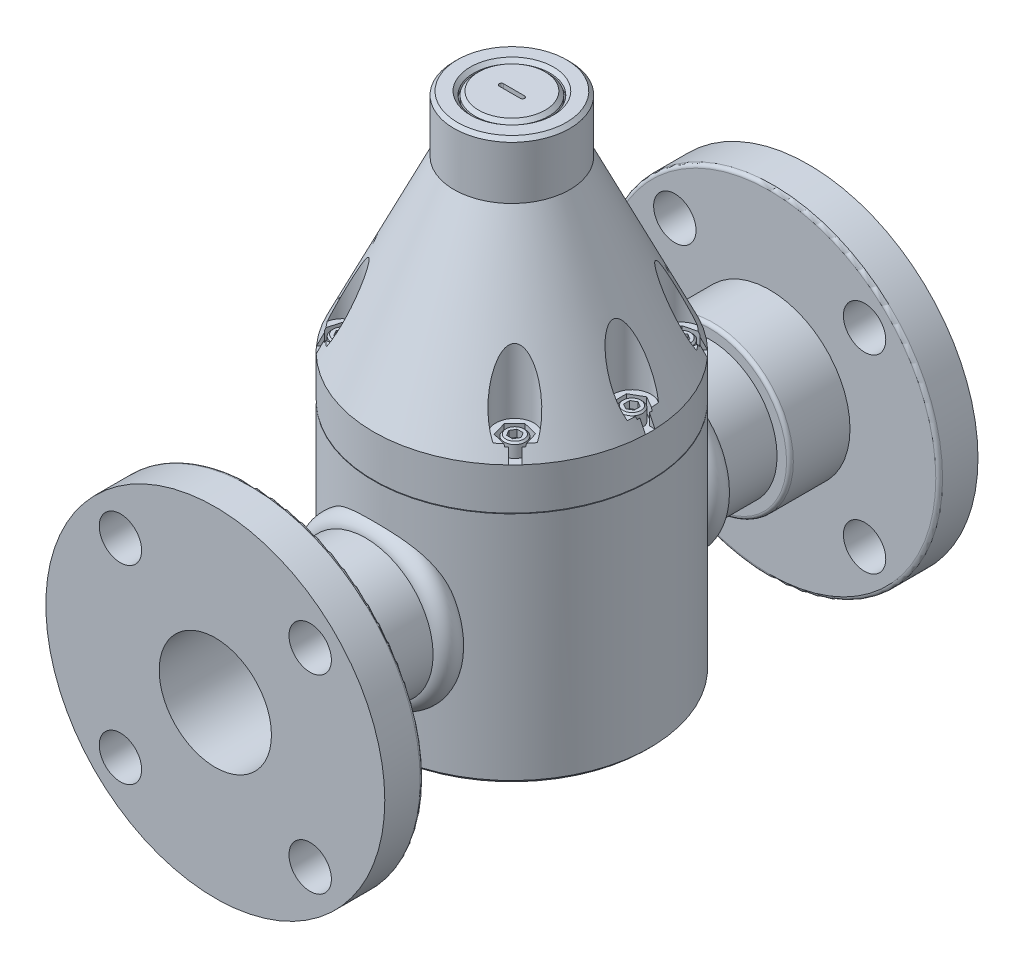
from build123d import *

# Parameters (mm, degrees)
SKETCH1_R                = 62.23
EXTRUDE1_DEPTH           = 226.06
SKETCH3_R                = 8.5725
EXTRUDE2_DEPTH           = 50.8
EXTRUDE3_DEPTH           = 6.223
SKETCH5_W                = 7.654715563
SKETCH5_H                = 4.2672
EXTRUDE4_DEPTH           = 6.223
SKETCH6_R                = 4.7625
EXTRUDE6_DEPTH           = 6.223
EXTRUDE7_DEPTH           = 3.175
CHAMFER1_SIZE            = 0.762
CHAMFER1_OF_MIRROR1_SIZE = 0.762
SKETCH8_R                = 17.145
EXTRUDE8_DEPTH           = 3.175
SKETCH9_R                = 16.51
EXTRUDE9_DEPTH           = 3.175
EXTRUDE10_DEPTH          = 3.175
CHAMFER2_SIZE            = 1.5748
CHAMFER3_SIZE            = 1.5748
CHAMFER4_SIZE            = 1.5748
SKETCH11_R               = 76.2
BOSS_EXTRUDE1_DEPTH      = 17.4498
SKETCH12_R               = 76.2
BOSS_EXTRUDE2_DEPTH      = 17.4498
SKETCH13_R               = 36.1061
BOSS_EXTRUDE3_DEPTH      = 44.45
SKETCH14_R               = 36.1061
BOSS_EXTRUDE4_DEPTH      = 44.45
BOSS_EXTRUDE5_REACH      = 359.825
BOSS_EXTRUDE5_END_RADIUS = 62.23
SKETCH15_R               = 30.3149
SKETCH16_R               = 25.2349
CUT_EXTRUDE1_DEPTH       = 76.2
BOSS_EXTRUDE6_REACH      = 359.825
BOSS_EXTRUDE6_END_RADIUS = 62.23
SKETCH17_R               = 30.3149
CUT_EXTRUDE2_START       = 76.2
SKETCH18_R               = 25.2349
CUT_EXTRUDE2_DEPTH       = 76.2
FILLET1_R                = 1.524
SKETCH19_R               = 9.525
CUT_EXTRUDE3_DEPTH       = 25.4
CIRPATTERN1_COUNT        = 4
CUT_EXTRUDE4_START       = 25.4
SKETCH20_R               = 9.525
CUT_EXTRUDE4_DEPTH       = 25.4
CIRPATTERN2_COUNT        = 4


with BuildPart() as part:
    # Sketch1 → Extrude1 (new body)
    with BuildSketch(Plane(origin=(0, 0, 0), x_dir=(1, 0, 0), z_dir=(0, 1, 0))):
        with Locations(Location((0, 0, 0), (0, 0, 90))):
            Circle(SKETCH1_R)
    extrude(amount=EXTRUDE1_DEPTH)

    # Sketch2 → Cut-Revolve1 (revolve, cut)
    with BuildSketch(Plane.XY, mode=Mode.PRIVATE) as cut_revolve1_sk:
        Polygon((-67.536130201, 105.41), (-45.085, 105.41), (-45.085, 105.664), (-62.23, 105.664), (-62.23, 124.46), (-26.035, 200.66), (-26.035, 228.6), (-77.461567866, 228.6), (-77.461567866, 105.41), align=None)
    revolve(cut_revolve1_sk.sketch.rotate(Axis((0, 0, 0), (0, 1, 0)), 180), axis=Axis((0, 0, 0), (0, 1, 0)), mode=Mode.SUBTRACT)

    # Sketch3 → Extrude2 (cut)
    with BuildSketch(Plane(origin=(0, 130.683, 0), x_dir=(-1, 0, 0), z_dir=(0, 1, 0))):
        with Locations((-38.826365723, 37.494185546)):
            Circle(SKETCH3_R)
        with Locations((-53.975, 0)):
            Circle(SKETCH3_R)
        with Locations((-38.826365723, -37.494185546)):
            Circle(SKETCH3_R)
    extrude2 = extrude(amount=EXTRUDE2_DEPTH, mode=Mode.SUBTRACT)

    # Sketch4 → Extrude3 (cut)
    with BuildSketch(Plane(origin=(0, 130.683, 0), x_dir=(-1, 0, 0), z_dir=(0, 1, 0))):
        Polygon((-43.410495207, 32.747180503), (-37.007403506, 31.150710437), (-32.423274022, 35.89771548), (-34.24223624, 42.241190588), (-40.64532794, 43.837660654), (-45.229457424, 39.090655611), align=None)
        Polygon((-53.975, 6.599113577), (-59.69, 3.299556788), (-59.69, -3.299556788), (-53.975, -6.599113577), (-48.26, -3.299556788), (-48.26, 3.299556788), align=None)
        Polygon((-43.410495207, -32.747180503), (-45.229457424, -39.090655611), (-40.64532794, -43.837660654), (-34.24223624, -42.241190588), (-32.423274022, -35.89771548), (-37.007403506, -31.150710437), align=None)
    extrude3 = extrude(amount=-EXTRUDE3_DEPTH, mode=Mode.SUBTRACT)

    # Sketch5 → Extrude4 (cut)
    with BuildSketch(Plane(origin=(0, 130.683, 0), x_dir=(-1, 0, 0), z_dir=(0, 1, 0))):
        Polygon((-39.947895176, 41.543286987), (-44.67273389, 46.106010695), (-47.49211039, 42.896544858), (-43.148780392, 38.702239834), align=None)
        with Locations((-60.345020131, 0)):
            Rectangle(SKETCH5_W, SKETCH5_H)
        Polygon((-41.449258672, -37.061030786), (-47.658063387, -43.056803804), (-44.752470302, -46.183011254), (-38.871838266, -40.504150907), align=None)
    extrude4 = extrude(amount=-EXTRUDE4_DEPTH, mode=Mode.SUBTRACT)

    # Sketch6 → Extrude6 (add)
    with BuildSketch(Plane(origin=(0, 130.683, 0), x_dir=(-1, 0, 0), z_dir=(0, 1, 0))):
        with Locations(Location((-38.826365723, 37.494185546, 0), (0, 0, 90))):
            Circle(SKETCH6_R)
        with Locations(Location((-53.975, 0, 0), (0, 0, 90))):
            Circle(SKETCH6_R)
        with Locations(Location((-38.826365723, -37.494185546, 0), (0, 0, 90))):
            Circle(SKETCH6_R)
    extrude6 = extrude(amount=-EXTRUDE6_DEPTH)

    # Sketch7 → Extrude7 (cut)
    with BuildSketch(Plane(origin=(0, 130.683, 0), x_dir=(-1, 0, 0), z_dir=(0, 1, 0))):
        Polygon((-41.568664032, 37.494185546), (-40.197514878, 35.119285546), (-37.455216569, 35.119285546), (-36.084067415, 37.494185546), (-37.455216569, 39.869085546), (-40.197514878, 39.869085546), align=None)
        Polygon((-53.975, 2.742298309), (-56.3499, 1.371149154), (-56.3499, -1.371149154), (-53.975, -2.742298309), (-51.6001, -1.371149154), (-51.6001, 1.371149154), align=None)
        Polygon((-38.826365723, -34.751887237), (-41.201265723, -36.123036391), (-41.201265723, -38.8653347), (-38.826365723, -40.236483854), (-36.451465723, -38.8653347), (-36.451465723, -36.123036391), align=None)
    extrude7 = extrude(amount=-EXTRUDE7_DEPTH, mode=Mode.SUBTRACT)

    # Chamfer1
    chamfer1_edges = [part.edges().sort_by_distance(p)[0] for p in [
        (38.826365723, 130.683, 32.731685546),
        (53.975, 130.683, -4.7625),
        (38.826365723, 130.683, -42.256685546),
    ]]
    chamfer(chamfer1_edges, length=CHAMFER1_SIZE)

    # Mirror1: Extrude2, Extrude3, Extrude4, Extrude6, Extrude7 across plane
    add(extrude2.mirror(Plane(origin=(0, 0, 0), x_dir=(0, 0, 1), z_dir=(1, 0, 0))), mode=Mode.SUBTRACT)
    add(extrude3.mirror(Plane(origin=(0, 0, 0), x_dir=(0, 0, 1), z_dir=(1, 0, 0))), mode=Mode.SUBTRACT)
    add(extrude4.mirror(Plane(origin=(0, 0, 0), x_dir=(0, 0, 1), z_dir=(1, 0, 0))), mode=Mode.SUBTRACT)
    add(extrude6.mirror(Plane(origin=(0, 0, 0), x_dir=(0, 0, 1), z_dir=(1, 0, 0))))
    add(extrude7.mirror(Plane(origin=(0, 0, 0), x_dir=(0, 0, 1), z_dir=(1, 0, 0))), mode=Mode.SUBTRACT)

    # Chamfer1 of Mirror1
    chamfer1_of_mirror1_edges = [part.edges().sort_by_distance(p)[0] for p in [
        (-38.826365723, 130.683, 32.731685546),
        (-53.975, 130.683, -4.7625),
        (-38.826365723, 130.683, -42.256685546),
    ]]
    chamfer(chamfer1_of_mirror1_edges, length=CHAMFER1_OF_MIRROR1_SIZE)

    # Sketch8 → Extrude8 (cut)
    with BuildSketch(Plane(origin=(0, 226.06, 0), x_dir=(-1, 0, 0), z_dir=(0, 1, 0))):
        with Locations(Location((0, 0, 0), (0, 0, 90))):
            Circle(SKETCH8_R)
    extrude(amount=-EXTRUDE8_DEPTH, mode=Mode.SUBTRACT)

    # Sketch9 → Extrude9 (add)
    with BuildSketch(Plane(origin=(0, 226.06, 0), x_dir=(-1, 0, 0), z_dir=(0, 1, 0))):
        with Locations(Location((0, 0, 0), (0, 0, 90))):
            Circle(SKETCH9_R)
    extrude(amount=-EXTRUDE9_DEPTH)

    # Sketch10 → Extrude10 (cut)
    with BuildSketch(Plane(origin=(0, 226.06, 0), x_dir=(-1, 0, 0), z_dir=(0, 1, 0))):
        with BuildLine():
            Line((-4.7625, 0.9652), (4.7625, 0.9652))
            ThreePointArc((4.7625, 0.9652), (5.7277, 0), (4.7625, -0.9652))
            Line((4.7625, -0.9652), (-4.7625, -0.9652))
            ThreePointArc((-4.7625, -0.9652), (-5.7277, 0), (-4.7625, 0.9652))
        make_face()
    extrude(amount=-EXTRUDE10_DEPTH, mode=Mode.SUBTRACT)

    # Chamfer2
    chamfer2_edges = [part.edges().sort_by_distance(p)[0] for p in [
        (0, 226.06, -17.145),
        (-26.035, 226.06, 0),
    ]]
    chamfer(chamfer2_edges, length=CHAMFER2_SIZE)

    # Chamfer3
    chamfer3_edges = [part.edges().sort_by_distance(p)[0] for p in [
        (0, 226.06, -16.51),
    ]]
    chamfer(chamfer3_edges, length=CHAMFER3_SIZE)

    # Chamfer4
    chamfer4_edges = [part.edges().sort_by_distance(p)[0] for p in [
        (0, 0, 62.23),
    ]]
    chamfer(chamfer4_edges, length=CHAMFER4_SIZE)



with BuildPart() as body_2:
    # Sketch11 → Boss-Extrude1 (new body)
    with BuildSketch(Plane.XY.offset(133.35)):
        with Locations((0, 54.61)):
            Circle(SKETCH11_R)
    extrude(amount=-BOSS_EXTRUDE1_DEPTH)

    # Sketch13 → Boss-Extrude3 (add)
    with BuildSketch(Plane.XY.offset(133.35)):
        with Locations((0, 54.61)):
            Circle(SKETCH13_R)
    extrude(amount=-BOSS_EXTRUDE3_DEPTH)


with BuildPart() as body_3:
    # Sketch12 → Boss-Extrude2 (new body)
    with BuildSketch(Plane.XY.offset(-133.35)):
        with Locations((0, 54.61)):
            Circle(SKETCH12_R)
    extrude(amount=BOSS_EXTRUDE2_DEPTH)

    # Sketch14 → Boss-Extrude4 (add)
    with BuildSketch(Plane.XY.offset(-133.35)):
        with Locations((0, 54.61)):
            Circle(SKETCH14_R)
    extrude(amount=BOSS_EXTRUDE4_DEPTH)


with BuildPart() as part_1:
    add(part.part)

    add(body_2.part)  # Boss-Extrude5 merges body 2
    # Boss-Extrude5: up to this cylinder (the profile starts outside it)
    boss_extrude5_end = Plane(origin=(0, 54.61, 0), z_dir=(0, -1, 0)) * Cylinder(BOSS_EXTRUDE5_END_RADIUS, 845.11, mode=Mode.PRIVATE)
    # Sketch15 → Boss-Extrude5 (add, up to the surface)
    with BuildSketch(Plane.XY.offset(133.35), mode=Mode.PRIVATE) as boss_extrude5_sk1:
        with Locations((0, 54.61)):
            Circle(SKETCH15_R)
    boss_extrude5_tool1 = extrude(boss_extrude5_sk1.sketch, amount=-BOSS_EXTRUDE5_REACH, mode=Mode.PRIVATE) - boss_extrude5_end
    add(boss_extrude5_tool1.solids().sort_by_distance((0, 54.61, 133.35))[0])

    # Sketch16 → Cut-Extrude1 (cut)
    with BuildSketch(Plane.XY.offset(133.35)):
        with Locations((0, 54.61)):
            Circle(SKETCH16_R)
    extrude(amount=-CUT_EXTRUDE1_DEPTH, mode=Mode.SUBTRACT)


    add(body_3.part)  # Boss-Extrude6 merges body 3
    # Boss-Extrude6: up to this cylinder (the profile starts outside it)
    boss_extrude6_end = Plane(origin=(0, 54.61, 0), z_dir=(0, -1, 0)) * Cylinder(BOSS_EXTRUDE6_END_RADIUS, 845.11, mode=Mode.PRIVATE)
    # Sketch17 → Boss-Extrude6 (add, up to the surface)
    with BuildSketch(Plane.XY.offset(-133.35), mode=Mode.PRIVATE) as boss_extrude6_sk1:
        with Locations(Location((0, 54.61, 0), (0, 0, 180))):
            Circle(SKETCH17_R)
    boss_extrude6_tool1 = extrude(boss_extrude6_sk1.sketch, amount=BOSS_EXTRUDE6_REACH, mode=Mode.PRIVATE) - boss_extrude6_end
    add(boss_extrude6_tool1.solids().sort_by_distance((0, 54.61, -133.35))[0])

    # Sketch18 → Cut-Extrude2 (cut)
    with BuildSketch(Plane.XY.offset(-133.35).offset(CUT_EXTRUDE2_START)):
        with Locations((0, 54.61)):
            Circle(SKETCH18_R)
    extrude(amount=-CUT_EXTRUDE2_DEPTH, mode=Mode.SUBTRACT)

    # Fillet1
    fillet1_edges = [part_1.edges().sort_by_distance(p)[0] for p in [
        (-76.2, 54.61, -115.9002),
        (-76.2, 54.61, 115.9002),
        (-36.1061, 54.61, 88.9),
        (-36.1061, 54.61, -88.9),
    ]]
    fillet(fillet1_edges, radius=FILLET1_R)

    # Sketch19 → Cut-Extrude3 (cut)
    with BuildSketch(Plane.XY.offset(133.35)):
        with Locations((-42.656216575, 97.266216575)):
            Circle(SKETCH19_R)
    cut_extrude3 = extrude(amount=-CUT_EXTRUDE3_DEPTH, mode=Mode.SUBTRACT)

    # CirPattern1: Cut-Extrude3 ×4 about axis
    cirpattern1_axis = Axis((0, 54.61, 0), (0, 0, 1))
    for i in range(1, CIRPATTERN1_COUNT):
        add(cut_extrude3.rotate(cirpattern1_axis, i * 360 / CIRPATTERN1_COUNT), mode=Mode.SUBTRACT)

    # Sketch20 → Cut-Extrude4 (cut)
    with BuildSketch(Plane.XY.offset(-133.35).offset(CUT_EXTRUDE4_START)):
        with Locations((42.656216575, 97.266216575)):
            Circle(SKETCH20_R)
    cut_extrude4 = extrude(amount=-CUT_EXTRUDE4_DEPTH, mode=Mode.SUBTRACT)

    # CirPattern2: Cut-Extrude4 ×4 about axis
    cirpattern2_axis = Axis((0, 54.61, 0), (0, 0, 1))
    for i in range(1, CIRPATTERN2_COUNT):
        add(cut_extrude4.rotate(cirpattern2_axis, i * 360 / CIRPATTERN2_COUNT), mode=Mode.SUBTRACT)

    # Sketch21 → Revolve1 (revolve)
    with BuildSketch(Plane(origin=(0, 0, 0), x_dir=(0, 0, -1), z_dir=(1, 0, 0)), mode=Mode.PRIVATE) as revolve1_sk:
        with BuildLine():
            Line((-65.810091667, 81.444006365), (-65.810091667, 84.12064653))
            ThreePointArc((-65.810091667, 84.12064653), (-59.090226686, 90.129553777), (-53.867028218, 82.782326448))
            Line((-53.867028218, 82.782326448), (-53.867028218, 81.444006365))
            Line((-53.867028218, 81.444006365), (-65.810091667, 81.444006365))
        make_face()
    revolve1 = revolve(revolve1_sk.sketch.rotate(Axis((0, 54.61, 88.9), (0, 0, -1)), 229.310223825), axis=Axis((0, 54.61, 88.9), (0, 0, -1)))

    # Mirror2: Revolve1 across plane
    add(revolve1.mirror(Plane.XY))


solid = part_1.part
